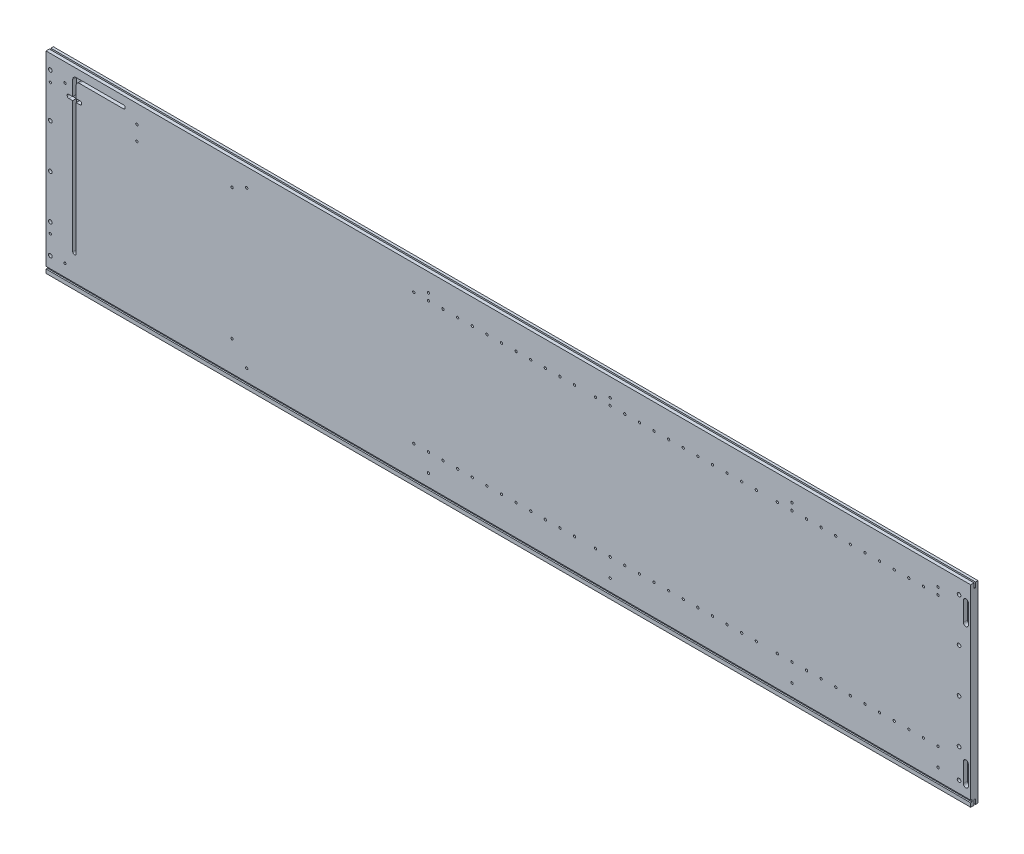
from build123d import *

# Parameters (mm, degrees)
SKIZZE1_W                                      = 2025
SKIZZE1_H                                      = 422
AUFSATZ_LINEAR_AUSTRAGEN1_DEPTH                = 16
F_8_0_8_DURCHMESSER_BOHRUNG1_D_BEL_D           = 8
F_8_0_8_DURCHMESSER_BOHRUNG1_D_BEL_DEPTH       = 11
F_8_0_8_DURCHMESSER_BOHRUNG1_D_BEL_TIP         = 2.403442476
SKIZZE4_W                                      = 3
SKIZZE4_H                                      = 5
SCHNITT_LINEAR_AUSTRAGEN1_RW_NUT_DEPTH         = 2037.026031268
SKIZZE7_W                                      = 3.2
SKIZZE7_H                                      = 11
SCHNITT_LINEAR_AUSTRAGEN3_ALU_PROFIL_NUT_DEPTH = 2037.026031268
SCHNITT_LINEAR_AUSTRAGEN4_H_HENVERSTELLE_DEPTH = 9
F_5_0_5_DURCHMESSER_BOHRUNG1_MITTELBODEN_D     = 5
F_5_0_5_DURCHMESSER_BOHRUNG1_MITTELBODEN_DEPTH = 12
F_5_0_5_DURCHMESSER_BOHRUNG1_MITTELBODEN_TIP   = 1.502151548
F_5_0_5_DURCHMESSER_BOHRUNG2_VERBINDER_D       = 5
SKIZZE15_W                                     = 8.365170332
SKIZZE15_H                                     = 3.2
SCHNITT_LINEAR_AUSTRAGEN1ALU_PROFIL_NUT_DEPTH  = 1093.855548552
F_5_0_5_DURCHMESSER_BOHRUNG1_D                 = 5
F_5_0_5_DURCHMESSER_BOHRUNG1_DEPTH             = 7
F_5_0_5_DURCHMESSER_BOHRUNG1_TIP               = 1.502151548
SCHNITT_LINEAR_AUSTRAGEN1_KLAPPE_DEPTH         = 8
F_5_0_5_BOHRUNG2_KLAPPE_D                      = 5
F_5_0_5_BOHRUNG2_KLAPPE_DEPTH                  = 8
F_5_0_5_BOHRUNG2_KLAPPE_TIP                    = 1.502151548


with BuildPart() as part:
    # Skizze1 → Aufsatz-Linear austragen1 (new body)
    with BuildSketch(Plane.XY):
        Rectangle(SKIZZE1_W, SKIZZE1_H)
    extrude(amount=AUFSATZ_LINEAR_AUSTRAGEN1_DEPTH)

    # 8.0 _8_ Durchmesser Bohrung1 D_bel
    with Locations(Plane.XY.offset(16)):
        with Locations((987, 179.5), (987, 83.5), (987, -12.5), (987, -108.5), (987, -172.5), (-1003, 179.5), (-1003, 83.5), (-1003, -12.5), (-1003, -108.5), (-1003, -172.5)):
            Hole(F_8_0_8_DURCHMESSER_BOHRUNG1_D_BEL_D / 2, depth=F_8_0_8_DURCHMESSER_BOHRUNG1_D_BEL_DEPTH)
            with Locations((0, 0, -(F_8_0_8_DURCHMESSER_BOHRUNG1_D_BEL_DEPTH + F_8_0_8_DURCHMESSER_BOHRUNG1_D_BEL_TIP / 2))):  # 118° drill point
                Cone(0, F_8_0_8_DURCHMESSER_BOHRUNG1_D_BEL_D / 2, F_8_0_8_DURCHMESSER_BOHRUNG1_D_BEL_TIP, mode=Mode.SUBTRACT)

    # Skizze4 → Schnitt-Linear austragen1 RW-Nut (cut, through all)
    with BuildSketch(Plane.ZY.offset(1012.5)):
        with Locations((14.5, -200)):
            Rectangle(SKIZZE4_W, SKIZZE4_H)
    extrude(amount=-SCHNITT_LINEAR_AUSTRAGEN1_RW_NUT_DEPTH, mode=Mode.SUBTRACT)

    # Skizze7 → Schnitt-Linear austragen3 Alu-Profil-Nut (cut, through all)
    with BuildSketch(Plane(origin=(1012.5, 0, 0), x_dir=(0, 0, -1), z_dir=(1, 0, 0))):
        with Locations((-7.1, 205.5)):
            Rectangle(SKIZZE7_W, SKIZZE7_H)
    schnitt_linear_austragen3_alu_profil_nut = extrude(amount=-SCHNITT_LINEAR_AUSTRAGEN3_ALU_PROFIL_NUT_DEPTH, mode=Mode.SUBTRACT)

    # Spiegeln1: Schnitt-Linear austragen3 Alu-Profil-Nut across plane
    add(schnitt_linear_austragen3_alu_profil_nut.mirror(Plane.ZX), mode=Mode.SUBTRACT)

    # Skizze9 → Schnitt-Linear austragen4 H_henverstelle (cut)
    with BuildSketch(Plane.XY.offset(16)):
        with BuildLine():
            Line((1007.3, 174), (1007.3, 131.8))
            ThreePointArc((1007.3, 131.8), (1001.9, 126.4), (996.5, 131.8))
            Line((996.5, 131.8), (996.5, 174))
            ThreePointArc((996.5, 174), (1001.9, 179.4), (1007.3, 174))
        make_face()
        with BuildLine():
            Line((1007.3, -131.8), (1007.3, -174))
            ThreePointArc((1007.3, -174), (1001.9, -179.4), (996.5, -174))
            Line((996.5, -174), (996.5, -131.8))
            ThreePointArc((996.5, -131.8), (1001.9, -126.4), (1007.3, -131.8))
        make_face()
    extrude(amount=-SCHNITT_LINEAR_AUSTRAGEN4_H_HENVERSTELLE_DEPTH, mode=Mode.SUBTRACT)

    # 5.0 _5_ Durchmesser Bohrung1 Mittelboden
    with Locations(Plane.XY.offset(16)):
        with Locations((589, 156), (191, 156), (-207, 156), (-207, -131), (191, -131), (589, -131), (-605, 156), (-605, -131), (-1003, 156), (-1003, -131)):
            Hole(F_5_0_5_DURCHMESSER_BOHRUNG1_MITTELBODEN_D / 2, depth=F_5_0_5_DURCHMESSER_BOHRUNG1_MITTELBODEN_DEPTH)
            with Locations((0, 0, -(F_5_0_5_DURCHMESSER_BOHRUNG1_MITTELBODEN_DEPTH + F_5_0_5_DURCHMESSER_BOHRUNG1_MITTELBODEN_TIP / 2))):  # 118° drill point
                Cone(0, F_5_0_5_DURCHMESSER_BOHRUNG1_MITTELBODEN_D / 2, F_5_0_5_DURCHMESSER_BOHRUNG1_MITTELBODEN_TIP, mode=Mode.SUBTRACT)

    # 5.0 _5_ Durchmesser Bohrung2 Verbinder (through all)
    with Locations(Plane.XY.offset(16)):
        with Locations((941, 171), (621, 171), (223, 171), (-175, 171), (-573, 171), (-971, 171), (-971, -171), (-573, -171), (-175, -171), (223, -171), (621, -171), (941, -171)):
            Hole(F_5_0_5_DURCHMESSER_BOHRUNG2_VERBINDER_D / 2)

    # Skizze15 → Schnitt-Linear austragen1Alu-Profil-Nut (cut, through all)
    with BuildSketch(Plane.XZ.offset(200)):
        with Locations((-1008.317414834, 7.1)):
            Rectangle(SKIZZE15_W, SKIZZE15_H)
    extrude(amount=-SCHNITT_LINEAR_AUSTRAGEN1ALU_PROFIL_NUT_DEPTH, mode=Mode.SUBTRACT)

    # 5.0 _5_ Durchmesser Bohrung1
    with Locations(Plane.XY.offset(16)):
        with Locations((621, 156), (653, 156), (685, 156), (717, 156), (749, 156), (781, 156), (813, 156), (845, 156), (877, 156), (909, 156), (941, 156), (621, -131), (653, -131), (685, -131), (717, -131), (749, -131), (781, -131), (813, -131), (845, -131), (877, -131), (909, -131), (941, -131), (-175, 156), (-143, 156), (-111, 156), (-79, 156), (-47, 156), (-15, 156), (17, 156), (49, 156), (81, 156), (113, 156), (145, 156), (-175, -131), (-143, -131), (-111, -131), (-79, -131), (-47, -131), (-15, -131), (17, -131), (49, -131), (81, -131), (113, -131), (145, -131), (223, 156), (255, 156), (287, 156), (319, 156), (351, 156), (383, 156), (415, 156), (447, 156), (479, 156), (511, 156), (543, 156), (223, -131), (255, -131), (287, -131), (319, -131), (351, -131), (383, -131), (415, -131), (447, -131), (479, -131), (511, -131), (543, -131)):
            Hole(F_5_0_5_DURCHMESSER_BOHRUNG1_D / 2, depth=F_5_0_5_DURCHMESSER_BOHRUNG1_DEPTH)
            with Locations((0, 0, -(F_5_0_5_DURCHMESSER_BOHRUNG1_DEPTH + F_5_0_5_DURCHMESSER_BOHRUNG1_TIP / 2))):  # 118° drill point
                Cone(0, F_5_0_5_DURCHMESSER_BOHRUNG1_D / 2, F_5_0_5_DURCHMESSER_BOHRUNG1_TIP, mode=Mode.SUBTRACT)

    # Skizze18 → Schnitt-Linear austragen1 Klappe (cut)
    with BuildSketch(Plane.XY.offset(16)):
        with BuildLine():
            Line((-946.5, -140.75), (-946.5, 146))
            Line((-946.5, 146), (-937.994999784, 146))
            ThreePointArc((-937.994999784, 146), (-934.245, 149.75), (-937.994999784, 153.5))
            Line((-937.994999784, 153.5), (-946.5, 153.5))
            Line((-946.5, 153.5), (-946.5, 178.5))
            ThreePointArc((-946.5, 178.5), (-944.303300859, 183.803300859), (-939, 186))
            Line((-939, 186), (-842.75, 186))
            ThreePointArc((-842.75, 186), (-839, 189.75), (-842.75, 193.5))
            Line((-842.75, 193.5), (-946.5, 193.5))
            ThreePointArc((-946.5, 193.5), (-951.803300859, 191.303300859), (-954, 186))
            Line((-954, 186), (-954, 153.5))
            Line((-954, 153.5), (-962.505000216, 153.5))
            ThreePointArc((-962.505000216, 153.5), (-966.255, 149.75), (-962.505000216, 146))
            Line((-962.505000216, 146), (-954, 146))
            Line((-954, 146), (-954, -140.75))
            ThreePointArc((-954, -140.75), (-950.25, -144.5), (-946.5, -140.75))
        make_face()
    extrude(amount=-SCHNITT_LINEAR_AUSTRAGEN1_KLAPPE_DEPTH, mode=Mode.SUBTRACT)

    # 5.0 _5_ Bohrung2 Klappe
    with Locations(Plane.XY.offset(16)):
        with Locations((-813.5, 171), (-813.5, 139)):
            Hole(F_5_0_5_BOHRUNG2_KLAPPE_D / 2, depth=F_5_0_5_BOHRUNG2_KLAPPE_DEPTH)
            with Locations((0, 0, -(F_5_0_5_BOHRUNG2_KLAPPE_DEPTH + F_5_0_5_BOHRUNG2_KLAPPE_TIP / 2))):  # 118° drill point
                Cone(0, F_5_0_5_BOHRUNG2_KLAPPE_D / 2, F_5_0_5_BOHRUNG2_KLAPPE_TIP, mode=Mode.SUBTRACT)


solid = part.part
